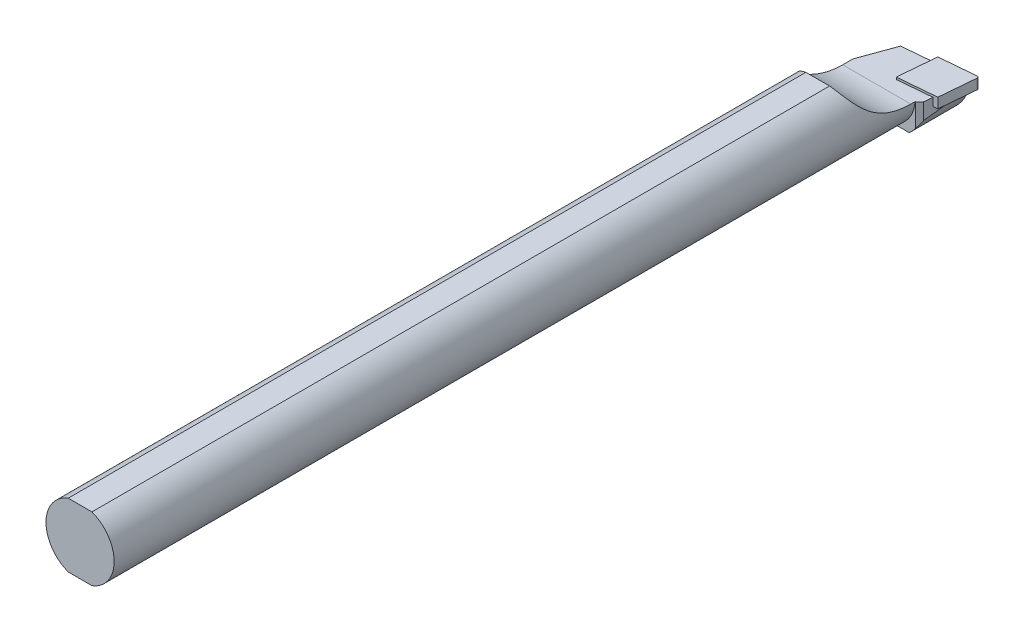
ISO-10303-21;
HEADER;
FILE_DESCRIPTION(('STEP AP214'),'2;1');
FILE_NAME('part.step','',(''),(''),'','','');
FILE_SCHEMA(('AUTOMOTIVE_DESIGN { 1 0 10303 214 1 1 1 1 }'));
ENDSEC;
DATA;
#1=APPLICATION_CONTEXT('core data for automotive mechanical design processes');
#2=APPLICATION_PROTOCOL_DEFINITION('international standard','automotive_design',2000,#1);
#3=PRODUCT_CONTEXT('',#1,'mechanical');
#4=PRODUCT('Part','Part','',(#3));
#5=PRODUCT_RELATED_PRODUCT_CATEGORY('part','',(#4));
#6=PRODUCT_DEFINITION_FORMATION('','',#4);
#7=PRODUCT_DEFINITION_CONTEXT('part definition',#1,'design');
#8=PRODUCT_DEFINITION('design','',#6,#7);
#9=PRODUCT_DEFINITION_SHAPE('','',#8);
#10=(LENGTH_UNIT() NAMED_UNIT(*) SI_UNIT(.MILLI.,.METRE.));
#11=(NAMED_UNIT(*) PLANE_ANGLE_UNIT() SI_UNIT($,.RADIAN.));
#12=(NAMED_UNIT(*) SI_UNIT($,.STERADIAN.) SOLID_ANGLE_UNIT());
#13=UNCERTAINTY_MEASURE_WITH_UNIT(LENGTH_MEASURE(1.E-05),#10,'distance_accuracy_value','');
#14=(GEOMETRIC_REPRESENTATION_CONTEXT(3) GLOBAL_UNCERTAINTY_ASSIGNED_CONTEXT((#13)) GLOBAL_UNIT_ASSIGNED_CONTEXT((#10,
#11,#12)) REPRESENTATION_CONTEXT('',''));
#15=CARTESIAN_POINT('',(0.,0.,0.));
#16=DIRECTION('',(0.,0.,1.));
#17=DIRECTION('',(1.,0.,0.));
#18=AXIS2_PLACEMENT_3D('',#15,#16,#17);
#19=CARTESIAN_POINT('',(-11.,0.,200.));
#20=DIRECTION('',(0.,0.,1.));
#21=DIRECTION('',(1.,0.,0.));
#22=AXIS2_PLACEMENT_3D('',#19,#20,#21);
#23=CYLINDRICAL_SURFACE('',#22,8.00000000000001);
#24=CARTESIAN_POINT('',(-11.,0.,1.96619513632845));
#25=DIRECTION('',(0.0871557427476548,0.,0.996194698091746));
#26=DIRECTION('',(-0.996194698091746,0.,0.0871557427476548));
#27=AXIS2_PLACEMENT_3D('',#24,#25,#26);
#28=ELLIPSE('',#27,8.03055870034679,8.00000000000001);
#29=CARTESIAN_POINT('',(-16.,-6.24499799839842,2.40363845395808));
#30=VERTEX_POINT('',#29);
#31=CARTESIAN_POINT('',(-13.783882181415,-7.50000000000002,2.20975326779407));
#32=VERTEX_POINT('',#31);
#33=EDGE_CURVE('E166',#30,#32,#28,.T.);
#34=ORIENTED_EDGE('',*,*,#33,.T.);
#35=DIRECTION('',(0.,0.,1.));
#36=VECTOR('',#35,1.);
#37=CARTESIAN_POINT('',(-13.783882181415,-7.50000000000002,200.));
#38=LINE('',#37,#36);
#39=CARTESIAN_POINT('',(-13.783882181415,-7.50000000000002,200.));
#40=VERTEX_POINT('',#39);
#41=EDGE_CURVE('E155',#32,#40,#38,.T.);
#42=ORIENTED_EDGE('',*,*,#41,.T.);
#43=CARTESIAN_POINT('',(-11.,0.,200.));
#44=DIRECTION('',(0.,0.,1.));
#45=DIRECTION('',(1.,0.,0.));
#46=AXIS2_PLACEMENT_3D('',#43,#44,#45);
#47=CIRCLE('',#46,8.00000000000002);
#48=CARTESIAN_POINT('',(-13.7838821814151,7.49999999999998,200.));
#49=VERTEX_POINT('',#48);
#50=EDGE_CURVE('E164',#49,#40,#47,.T.);
#51=ORIENTED_EDGE('',*,*,#50,.F.);
#52=DIRECTION('',(0.,0.,1.));
#53=VECTOR('',#52,1.);
#54=CARTESIAN_POINT('',(-13.7838821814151,7.49999999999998,200.));
#55=LINE('',#54,#53);
#56=CARTESIAN_POINT('',(-13.783882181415,7.5,26.856406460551));
#57=VERTEX_POINT('',#56);
#58=EDGE_CURVE('E302',#49,#57,#55,.F.);
#59=ORIENTED_EDGE('',*,*,#58,.T.);
#60=CARTESIAN_POINT('',(-3.01564028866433,-0.5,13.));
#61=CARTESIAN_POINT('',(-3.01565806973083,-0.500002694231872,13.2241838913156));
#62=CARTESIAN_POINT('',(-3.01534568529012,-0.495288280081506,13.4483654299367));
#63=CARTESIAN_POINT('',(-3.01418993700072,-0.476446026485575,13.8963298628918));
#64=CARTESIAN_POINT('',(-3.01334657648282,-0.46231824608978,14.1201127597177));
#65=CARTESIAN_POINT('',(-3.01125799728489,-0.424665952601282,14.5669374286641));
#66=CARTESIAN_POINT('',(-3.01001269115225,-0.401139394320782,14.7899790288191));
#67=CARTESIAN_POINT('',(-3.00738212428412,-0.344736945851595,15.2348607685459));
#68=CARTESIAN_POINT('',(-3.00599686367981,-0.311861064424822,15.4567009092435));
#69=CARTESIAN_POINT('',(-3.00210797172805,-0.198886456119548,16.1221890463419));
#70=CARTESIAN_POINT('',(-2.99988819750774,-0.104632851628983,16.56352245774));
#71=CARTESIAN_POINT('',(-3.00011995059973,0.120780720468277,17.4365342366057));
#72=CARTESIAN_POINT('',(-3.00257045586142,0.251932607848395,17.8682146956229));
#73=CARTESIAN_POINT('',(-3.0162908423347,0.525146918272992,18.6475245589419));
#74=CARTESIAN_POINT('',(-3.02601420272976,0.661699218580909,18.9971178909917));
#75=CARTESIAN_POINT('',(-3.05626741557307,0.958869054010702,19.6855076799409));
#76=CARTESIAN_POINT('',(-3.07679750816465,1.11948712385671,20.0243038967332));
#77=CARTESIAN_POINT('',(-3.13300000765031,1.46305150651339,20.6878642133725));
#78=CARTESIAN_POINT('',(-3.16862794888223,1.64593113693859,21.0126664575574));
#79=CARTESIAN_POINT('',(-3.25995757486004,2.03252659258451,21.646665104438));
#80=CARTESIAN_POINT('',(-3.31565156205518,2.23623440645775,21.9558674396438));
#81=CARTESIAN_POINT('',(-3.43255867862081,2.59979184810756,22.4685135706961));
#82=CARTESIAN_POINT('',(-3.4874631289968,2.75518082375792,22.6765761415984));
#83=CARTESIAN_POINT('',(-3.61201250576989,3.073573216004,23.0821782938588));
#84=CARTESIAN_POINT('',(-3.68165365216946,3.23657467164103,23.2797205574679));
#85=CARTESIAN_POINT('',(-3.83750967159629,3.56823018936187,23.6628803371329));
#86=CARTESIAN_POINT('',(-3.92370925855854,3.73687892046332,23.8485086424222));
#87=CARTESIAN_POINT('',(-4.11444192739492,4.07764459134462,24.2067329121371));
#88=CARTESIAN_POINT('',(-4.21897195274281,4.24976094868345,24.3793310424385));
#89=CARTESIAN_POINT('',(-4.42855230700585,4.56571370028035,24.6825080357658));
#90=CARTESIAN_POINT('',(-4.53057824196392,4.70945430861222,24.8152806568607));
#91=CARTESIAN_POINT('',(-4.74880642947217,4.9954900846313,25.0702925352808));
#92=CARTESIAN_POINT('',(-4.86500584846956,5.13778553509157,25.1925338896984));
#93=CARTESIAN_POINT('',(-5.11182922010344,5.41889505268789,25.4259691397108));
#94=CARTESIAN_POINT('',(-5.24245239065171,5.55770930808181,25.5371636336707));
#95=CARTESIAN_POINT('',(-5.51802931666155,5.82970605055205,25.7481388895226));
#96=CARTESIAN_POINT('',(-5.66298329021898,5.96288845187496,25.8479194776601));
#97=CARTESIAN_POINT('',(-5.96747629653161,6.22204619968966,26.0363096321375));
#98=CARTESIAN_POINT('',(-6.12708123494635,6.34798437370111,26.1248639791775));
#99=CARTESIAN_POINT('',(-6.45945948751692,6.58982009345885,26.2902281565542));
#100=CARTESIAN_POINT('',(-6.63223305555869,6.70571744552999,26.367037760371));
#101=CARTESIAN_POINT('',(-6.9897868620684,6.92547654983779,26.509059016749));
#102=CARTESIAN_POINT('',(-7.17456693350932,7.029338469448,26.5742708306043));
#103=CARTESIAN_POINT('',(-7.55470825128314,7.22325991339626,26.693375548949));
#104=CARTESIAN_POINT('',(-7.75006875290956,7.3133204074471,26.747269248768));
#105=CARTESIAN_POINT('',(-8.13274694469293,7.47114410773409,26.8399827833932));
#106=CARTESIAN_POINT('',(-8.31933737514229,7.5401517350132,26.8796943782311));
#107=CARTESIAN_POINT('',(-8.69866809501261,7.66444396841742,26.9502392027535));
#108=CARTESIAN_POINT('',(-8.89140827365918,7.71972882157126,26.9810725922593));
#109=CARTESIAN_POINT('',(-9.28159094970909,7.8158453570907,27.0341292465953));
#110=CARTESIAN_POINT('',(-9.47903284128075,7.85667889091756,27.0563536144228));
#111=CARTESIAN_POINT('',(-9.87718442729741,7.92338488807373,27.0924215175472));
#112=CARTESIAN_POINT('',(-10.0778941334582,7.94925729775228,27.1062650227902));
#113=CARTESIAN_POINT('',(-10.4771237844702,7.98536044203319,27.1255301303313));
#114=CARTESIAN_POINT('',(-10.6756091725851,7.99588876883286,27.1311119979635));
#115=CARTESIAN_POINT('',(-11.0728736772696,8.00213420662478,27.1344268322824));
#116=CARTESIAN_POINT('',(-11.2716527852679,7.99785174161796,27.1321600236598));
#117=CARTESIAN_POINT('',(-11.6680881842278,7.97452713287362,27.1197532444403));
#118=CARTESIAN_POINT('',(-11.8657445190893,7.95548557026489,27.1096135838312));
#119=CARTESIAN_POINT('',(-12.258537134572,7.90286956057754,27.0813528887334));
#120=CARTESIAN_POINT('',(-12.453673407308,7.86929506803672,27.0632318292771));
#121=CARTESIAN_POINT('',(-12.8400229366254,7.78802157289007,27.0188276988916));
#122=CARTESIAN_POINT('',(-13.0312364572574,7.74032352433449,26.9925451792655));
#123=CARTESIAN_POINT('',(-13.4083955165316,7.63139296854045,26.9315797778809));
#124=CARTESIAN_POINT('',(-13.5943410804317,7.57016052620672,26.8968969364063));
#125=CARTESIAN_POINT('',(-13.9596305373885,7.43495191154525,26.8188670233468));
#126=CARTESIAN_POINT('',(-14.1389754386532,7.36097769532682,26.7755212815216));
#127=CARTESIAN_POINT('',(-14.4898646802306,7.20125011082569,26.6798906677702));
#128=CARTESIAN_POINT('',(-14.6614090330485,7.11549676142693,26.627605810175));
#129=CARTESIAN_POINT('',(-14.9957920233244,6.93324951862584,26.5137831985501));
#130=CARTESIAN_POINT('',(-15.1586192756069,6.83674206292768,26.4522337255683));
#131=CARTESIAN_POINT('',(-15.4743541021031,6.63440379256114,26.3197529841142));
#132=CARTESIAN_POINT('',(-15.6272617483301,6.52857304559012,26.2488217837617));
#133=CARTESIAN_POINT('',(-15.9223591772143,6.30905680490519,26.0974931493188));
#134=CARTESIAN_POINT('',(-16.0645494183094,6.19537164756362,26.0170961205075));
#135=CARTESIAN_POINT('',(-16.3376423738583,5.96170061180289,25.8468570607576));
#136=CARTESIAN_POINT('',(-16.4685448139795,5.8417145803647,25.757014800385));
#137=CARTESIAN_POINT('',(-16.7225449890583,5.59329909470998,25.5651362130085));
#138=CARTESIAN_POINT('',(-16.8452812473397,5.46472361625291,25.4628108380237));
#139=CARTESIAN_POINT('',(-17.0782811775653,5.20432784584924,25.2485738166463));
#140=CARTESIAN_POINT('',(-17.1885448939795,5.07250756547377,25.1366622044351));
#141=CARTESIAN_POINT('',(-17.3967687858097,4.80726366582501,24.9036359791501));
#142=CARTESIAN_POINT('',(-17.4947270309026,4.67383979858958,24.7825199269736));
#143=CARTESIAN_POINT('',(-17.678714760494,4.40693282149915,24.531584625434));
#144=CARTESIAN_POINT('',(-17.7647418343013,4.2734497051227,24.4017636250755));
#145=CARTESIAN_POINT('',(-17.9571517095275,3.9553647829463,24.0810875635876));
#146=CARTESIAN_POINT('',(-18.058162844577,3.77138616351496,23.8863704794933));
#147=CARTESIAN_POINT('',(-18.2400537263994,3.40921290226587,23.4826758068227));
#148=CARTESIAN_POINT('',(-18.32092691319,3.23102016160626,23.2736935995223));
#149=CARTESIAN_POINT('',(-18.4649875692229,2.88263120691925,22.8427089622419));
#150=CARTESIAN_POINT('',(-18.5281423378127,2.71245025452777,22.6206833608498));
#151=CARTESIAN_POINT('',(-18.6390266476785,2.382349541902,22.1654977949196));
#152=CARTESIAN_POINT('',(-18.6867556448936,2.22243014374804,21.9323374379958));
#153=CARTESIAN_POINT('',(-18.7846014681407,1.85686698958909,21.3675711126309));
#154=CARTESIAN_POINT('',(-18.8289917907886,1.6563658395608,21.031631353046));
#155=CARTESIAN_POINT('',(-18.8992861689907,1.27983450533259,20.3444263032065));
#156=CARTESIAN_POINT('',(-18.9251830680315,1.10381381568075,19.9931551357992));
#157=CARTESIAN_POINT('',(-18.963811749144,0.777633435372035,19.2774848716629));
#158=CARTESIAN_POINT('',(-18.9765228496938,0.627514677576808,18.9130660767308));
#159=CARTESIAN_POINT('',(-18.9933091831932,0.354557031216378,18.1740427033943));
#160=CARTESIAN_POINT('',(-18.9973856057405,0.231714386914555,17.7994395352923));
#161=CARTESIAN_POINT('',(-19.0006427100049,0.0195267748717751,17.0613857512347));
#162=CARTESIAN_POINT('',(-19.000060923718,-0.0711998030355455,16.6983313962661));
#163=CARTESIAN_POINT('',(-18.9971601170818,-0.226993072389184,15.9667359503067));
#164=CARTESIAN_POINT('',(-18.9948411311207,-0.292060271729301,15.5981949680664));
#165=CARTESIAN_POINT('',(-18.9914760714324,-0.370068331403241,15.0434410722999));
#166=CARTESIAN_POINT('',(-18.990375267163,-0.392780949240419,14.8585515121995));
#167=CARTESIAN_POINT('',(-18.988365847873,-0.431738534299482,14.4880825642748));
#168=CARTESIAN_POINT('',(-18.98745723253,-0.447983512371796,14.3025031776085));
#169=CARTESIAN_POINT('',(-18.9859574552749,-0.47398352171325,13.930884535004));
#170=CARTESIAN_POINT('',(-18.9853663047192,-0.483738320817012,13.7448452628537));
#171=CARTESIAN_POINT('',(-18.984563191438,-0.496747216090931,13.372537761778));
#172=CARTESIAN_POINT('',(-18.9843512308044,-0.500001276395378,13.1862695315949));
#173=CARTESIAN_POINT('',(-18.9843597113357,-0.500000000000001,13.));
#174=B_SPLINE_CURVE_WITH_KNOTS('',3,(#60,#61,#62,#63,#64,#65,#66,#67,#68,#69,#70,#71,#72,#73,
#74,#75,#76,#77,#78,#79,#80,#81,#82,#83,#84,#85,#86,#87,#88,#89,#90,#91,#92,#93,#94,#95,#96,#97,
#98,#99,#100,#101,#102,#103,#104,#105,#106,#107,#108,#109,#110,#111,#112,#113,#114,#115,#116,
#117,#118,#119,#120,#121,#122,#123,#124,#125,#126,#127,#128,#129,#130,#131,#132,#133,#134,#135,
#136,#137,#138,#139,#140,#141,#142,#143,#144,#145,#146,#147,#148,#149,#150,#151,#152,#153,#154,
#155,#156,#157,#158,#159,#160,#161,#162,#163,#164,#165,#166,#167,#168,#169,#170,#171,#172,#173),
.UNSPECIFIED.,.F.,.F.,(4,2,2,2,2,2,2,2,2,2,2,2,2,2,2,2,2,2,2,2,2,2,2,2,2,2,2,2,2,2,2,2,2,2,2,2,
2,2,2,2,2,2,2,2,2,2,2,2,2,2,2,2,2,2,2,2,4),(0.,0.672497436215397,1.34499065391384,
2.01763028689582,2.69026928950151,4.04239668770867,5.39422821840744,6.51955457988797,
7.64490594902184,8.76696575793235,9.88859559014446,10.6842338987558,11.4796683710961,
12.2743720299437,13.068943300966,13.7303228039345,14.3915703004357,15.0527819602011,
15.7140036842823,16.3783610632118,17.0427312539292,17.7070922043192,18.3714064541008,
18.9792693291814,19.5871212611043,20.1948952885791,20.8026714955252,21.3984956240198,
21.9943026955,22.5900863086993,23.1858717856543,23.7816170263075,24.3773594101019,
24.9730104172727,25.5686604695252,26.1650704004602,26.7614760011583,27.3578560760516,
27.9542506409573,28.5688979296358,29.1835430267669,29.7982844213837,30.4131498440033,
31.2707553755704,32.1286399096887,32.9880974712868,33.8475853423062,35.0270580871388,
36.2069870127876,37.3887638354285,38.5703778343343,39.6921376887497,40.8138753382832,
41.3726307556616,41.9313852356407,42.4901597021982,43.0489372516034),.UNSPECIFIED.);
#175=CARTESIAN_POINT('',(-18.9843597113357,-0.5,13.));
#176=VERTEX_POINT('',#175);
#177=EDGE_CURVE('E184',#57,#176,#174,.T.);
#178=ORIENTED_EDGE('',*,*,#177,.T.);
#179=DIRECTION('',(0.,0.,1.));
#180=VECTOR('',#179,1.);
#181=CARTESIAN_POINT('',(-18.9843597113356,-0.500000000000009,200.));
#182=LINE('',#181,#180);
#183=CARTESIAN_POINT('',(-18.9843597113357,-0.499999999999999,10.6030993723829));
#184=VERTEX_POINT('',#183);
#185=EDGE_CURVE('E289',#176,#184,#182,.F.);
#186=ORIENTED_EDGE('',*,*,#185,.T.);
#187=CARTESIAN_POINT('',(-11.,0.,-11.333748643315));
#188=DIRECTION('',(0.939692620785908,0.,0.342020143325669));
#189=DIRECTION('',(-0.342020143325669,0.,0.939692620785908));
#190=AXIS2_PLACEMENT_3D('',#187,#188,#189);
#191=ELLIPSE('',#190,23.3904352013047,8.00000000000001);
#192=EDGE_CURVE('E174',#184,#30,#191,.T.);
#193=ORIENTED_EDGE('',*,*,#192,.T.);
#194=EDGE_LOOP('',(#34,#42,#51,#59,#178,#186,#193));
#195=FACE_BOUND('',#194,.T.);
#196=ADVANCED_FACE('F30',(#195),#23,.T.);
#197=CARTESIAN_POINT('',(-11.,0.,50.));
#198=DIRECTION('',(0.,0.,-1.));
#199=DIRECTION('',(-1.,0.,0.));
#200=AXIS2_PLACEMENT_3D('',#197,#198,#199);
#201=CYLINDRICAL_SURFACE('',#200,10.);
#202=DIRECTION('',(0.,0.,-1.));
#203=VECTOR('',#202,1.);
#204=CARTESIAN_POINT('',(-4.38562172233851,-7.50000000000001,50.));
#205=LINE('',#204,#203);
#206=CARTESIAN_POINT('',(-4.38562172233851,-7.5,1.38751202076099));
#207=VERTEX_POINT('',#206);
#208=CARTESIAN_POINT('',(-4.38562172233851,-7.5,12.));
#209=VERTEX_POINT('',#208);
#210=EDGE_CURVE('E251',#207,#209,#205,.F.);
#211=ORIENTED_EDGE('',*,*,#210,.F.);
#212=CARTESIAN_POINT('',(-11.,0.,1.96619513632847));
#213=DIRECTION('',(0.0871557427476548,0.,0.996194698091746));
#214=DIRECTION('',(0.996194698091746,0.,-0.0871557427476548));
#215=AXIS2_PLACEMENT_3D('',#212,#213,#214);
#216=ELLIPSE('',#215,10.0381983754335,10.);
#217=CARTESIAN_POINT('',(-1.28734845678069,-2.38,1.11644823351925));
#218=VERTEX_POINT('',#217);
#219=EDGE_CURVE('E256',#207,#218,#216,.T.);
#220=ORIENTED_EDGE('',*,*,#219,.T.);
#221=DIRECTION('',(0.,0.,-1.));
#222=VECTOR('',#221,1.);
#223=CARTESIAN_POINT('',(-1.28734845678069,-2.38,50.));
#224=LINE('',#223,#222);
#225=CARTESIAN_POINT('',(-1.28734845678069,-2.38,3.24074694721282));
#226=VERTEX_POINT('',#225);
#227=EDGE_CURVE('E192',#218,#226,#224,.F.);
#228=ORIENTED_EDGE('',*,*,#227,.T.);
#229=CARTESIAN_POINT('',(-11.,0.,114.256862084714));
#230=DIRECTION('',(0.996194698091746,0.,0.0871557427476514));
#231=DIRECTION('',(0.0871557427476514,0.,-0.996194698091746));
#232=AXIS2_PLACEMENT_3D('',#229,#230,#231);
#233=ELLIPSE('',#232,114.737132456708,10.);
#234=CARTESIAN_POINT('',(-1.97162029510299,-4.29980928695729,11.062009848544));
#235=VERTEX_POINT('',#234);
#236=EDGE_CURVE('E266',#235,#226,#233,.T.);
#237=ORIENTED_EDGE('',*,*,#236,.F.);
#238=CARTESIAN_POINT('',(-11.,0.,20.090389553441));
#239=DIRECTION('',(0.707106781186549,0.,0.707106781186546));
#240=DIRECTION('',(0.707106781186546,0.,-0.707106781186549));
#241=AXIS2_PLACEMENT_3D('',#238,#239,#240);
#242=ELLIPSE('',#241,14.142135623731,10.);
#243=CARTESIAN_POINT('',(-2.90961044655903,-5.87755024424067,12.));
#244=VERTEX_POINT('',#243);
#245=EDGE_CURVE('E254',#244,#235,#242,.T.);
#246=ORIENTED_EDGE('',*,*,#245,.F.);
#247=CARTESIAN_POINT('',(-11.,0.,12.));
#248=DIRECTION('',(0.,0.,1.));
#249=DIRECTION('',(0.,-1.,0.));
#250=AXIS2_PLACEMENT_3D('',#247,#248,#249);
#251=CIRCLE('',#250,10.);
#252=EDGE_CURVE('E245',#209,#244,#251,.T.);
#253=ORIENTED_EDGE('',*,*,#252,.F.);
#254=EDGE_LOOP('',(#211,#220,#228,#237,#246,#253));
#255=FACE_BOUND('',#254,.T.);
#256=ADVANCED_FACE('F212',(#255),#201,.T.);
#257=CARTESIAN_POINT('',(-16.,-50.,2.40363845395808));
#258=DIRECTION('',(0.0871557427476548,0.,0.996194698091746));
#259=DIRECTION('',(0.996194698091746,0.,-0.0871557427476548));
#260=AXIS2_PLACEMENT_3D('',#257,#258,#259);
#261=PLANE('',#260);
#262=ORIENTED_EDGE('',*,*,#219,.F.);
#263=DIRECTION('',(-0.996194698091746,0.,0.0871557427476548));
#264=VECTOR('',#263,1.);
#265=CARTESIAN_POINT('',(-16.,-7.5,2.40363845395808));
#266=LINE('',#265,#264);
#267=EDGE_CURVE('E249',#207,#32,#266,.T.);
#268=ORIENTED_EDGE('',*,*,#267,.T.);
#269=ORIENTED_EDGE('',*,*,#33,.F.);
#270=DIRECTION('',(0.,1.,0.));
#271=VECTOR('',#270,1.);
#272=CARTESIAN_POINT('',(-16.,-50.,2.40363845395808));
#273=LINE('',#272,#271);
#274=CARTESIAN_POINT('',(-16.,-0.5,2.40363845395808));
#275=VERTEX_POINT('',#274);
#276=EDGE_CURVE('E176',#30,#275,#273,.T.);
#277=ORIENTED_EDGE('',*,*,#276,.T.);
#278=DIRECTION('',(0.996194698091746,0.,-0.0871557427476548));
#279=VECTOR('',#278,1.);
#280=CARTESIAN_POINT('',(-16.,-0.5,2.40363845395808));
#281=LINE('',#280,#279);
#282=CARTESIAN_POINT('',(-9.01744742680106,-0.5,1.79274426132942));
#283=VERTEX_POINT('',#282);
#284=EDGE_CURVE('E181',#275,#283,#281,.T.);
#285=ORIENTED_EDGE('',*,*,#284,.T.);
#286=DIRECTION('',(0.,-1.,0.));
#287=VECTOR('',#286,1.);
#288=CARTESIAN_POINT('',(-9.01744742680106,-50.,1.79274426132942));
#289=LINE('',#288,#287);
#290=CARTESIAN_POINT('',(-9.01744742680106,-2.38,1.79274426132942));
#291=VERTEX_POINT('',#290);
#292=EDGE_CURVE('E257',#283,#291,#289,.T.);
#293=ORIENTED_EDGE('',*,*,#292,.T.);
#294=DIRECTION('',(-0.996194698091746,0.,0.0871557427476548));
#295=VECTOR('',#294,1.);
#296=CARTESIAN_POINT('',(-16.,-2.38,2.40363845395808));
#297=LINE('',#296,#295);
#298=EDGE_CURVE('E312',#218,#291,#297,.T.);
#299=ORIENTED_EDGE('',*,*,#298,.F.);
#300=EDGE_LOOP('',(#262,#268,#269,#277,#285,#293,#299));
#301=FACE_BOUND('',#300,.T.);
#302=ADVANCED_FACE('F208',(#301),#261,.F.);
#303=CARTESIAN_POINT('',(-11.,-8.,12.));
#304=DIRECTION('',(0.,0.,1.));
#305=DIRECTION('',(0.,-1.,0.));
#306=AXIS2_PLACEMENT_3D('',#303,#304,#305);
#307=PLANE('',#306);
#308=DIRECTION('',(-1.,0.,0.));
#309=VECTOR('',#308,1.);
#310=CARTESIAN_POINT('',(-11.,-7.5,12.));
#311=LINE('',#310,#309);
#312=CARTESIAN_POINT('',(-8.21611781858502,-7.50000000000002,12.));
#313=VERTEX_POINT('',#312);
#314=EDGE_CURVE('E167',#209,#313,#311,.T.);
#315=ORIENTED_EDGE('',*,*,#314,.F.);
#316=ORIENTED_EDGE('',*,*,#252,.T.);
#317=DIRECTION('',(0.,1.,0.));
#318=VECTOR('',#317,1.);
#319=CARTESIAN_POINT('',(-2.90961044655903,-8.,12.));
#320=LINE('',#319,#318);
#321=CARTESIAN_POINT('',(-2.90961044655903,-0.499999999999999,12.));
#322=VERTEX_POINT('',#321);
#323=EDGE_CURVE('E278',#244,#322,#320,.T.);
#324=ORIENTED_EDGE('',*,*,#323,.T.);
#325=DIRECTION('',(1.,0.,0.));
#326=VECTOR('',#325,1.);
#327=CARTESIAN_POINT('',(-11.,-0.499999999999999,12.));
#328=LINE('',#327,#326);
#329=CARTESIAN_POINT('',(-3.01564028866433,-0.499999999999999,12.));
#330=VERTEX_POINT('',#329);
#331=EDGE_CURVE('E272',#330,#322,#328,.T.);
#332=ORIENTED_EDGE('',*,*,#331,.F.);
#333=CARTESIAN_POINT('',(-11.,0.,12.));
#334=DIRECTION('',(0.,0.,1.));
#335=DIRECTION('',(0.,-1.,0.));
#336=AXIS2_PLACEMENT_3D('',#333,#334,#335);
#337=CIRCLE('',#336,8.00000000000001);
#338=EDGE_CURVE('E248',#313,#330,#337,.T.);
#339=ORIENTED_EDGE('',*,*,#338,.F.);
#340=EDGE_LOOP('',(#315,#316,#324,#332,#339));
#341=FACE_BOUND('',#340,.T.);
#342=ADVANCED_FACE('F211',(#341),#307,.T.);
#343=CARTESIAN_POINT('',(-1.97162029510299,-8.,11.062009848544));
#344=DIRECTION('',(0.996194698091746,0.,0.0871557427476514));
#345=DIRECTION('',(0.0871557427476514,0.,-0.996194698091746));
#346=AXIS2_PLACEMENT_3D('',#343,#344,#345);
#347=PLANE('',#346);
#348=DIRECTION('',(0.,-1.,0.));
#349=VECTOR('',#348,1.);
#350=CARTESIAN_POINT('',(-1.79274426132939,-8.,9.01744742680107));
#351=LINE('',#350,#349);
#352=CARTESIAN_POINT('',(-1.79274426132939,-0.5,9.01744742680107));
#353=VERTEX_POINT('',#352);
#354=CARTESIAN_POINT('',(-1.79274426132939,-2.38,9.01744742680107));
#355=VERTEX_POINT('',#354);
#356=EDGE_CURVE('E261',#353,#355,#351,.T.);
#357=ORIENTED_EDGE('',*,*,#356,.F.);
#358=DIRECTION('',(0.0871557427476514,0.,-0.996194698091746));
#359=VECTOR('',#358,1.);
#360=CARTESIAN_POINT('',(-1.97162029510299,-0.499999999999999,11.062009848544));
#361=LINE('',#360,#359);
#362=CARTESIAN_POINT('',(-1.97162029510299,-0.499999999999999,11.062009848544));
#363=VERTEX_POINT('',#362);
#364=EDGE_CURVE('E269',#363,#353,#361,.T.);
#365=ORIENTED_EDGE('',*,*,#364,.F.);
#366=DIRECTION('',(0.,1.,0.));
#367=VECTOR('',#366,1.);
#368=CARTESIAN_POINT('',(-1.97162029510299,-8.,11.062009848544));
#369=LINE('',#368,#367);
#370=EDGE_CURVE('E279',#235,#363,#369,.T.);
#371=ORIENTED_EDGE('',*,*,#370,.F.);
#372=ORIENTED_EDGE('',*,*,#236,.T.);
#373=DIRECTION('',(-0.0871557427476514,0.,0.996194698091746));
#374=VECTOR('',#373,1.);
#375=CARTESIAN_POINT('',(-1.97162029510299,-2.38,11.062009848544));
#376=LINE('',#375,#374);
#377=EDGE_CURVE('E309',#226,#355,#376,.T.);
#378=ORIENTED_EDGE('',*,*,#377,.T.);
#379=EDGE_LOOP('',(#357,#365,#371,#372,#378));
#380=FACE_BOUND('',#379,.T.);
#381=ADVANCED_FACE('F202',(#380),#347,.T.);
#382=CARTESIAN_POINT('',(-2.90961044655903,-8.,12.));
#383=DIRECTION('',(0.707106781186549,0.,0.707106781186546));
#384=DIRECTION('',(0.707106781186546,0.,-0.707106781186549));
#385=AXIS2_PLACEMENT_3D('',#382,#383,#384);
#386=PLANE('',#385);
#387=ORIENTED_EDGE('',*,*,#323,.F.);
#388=ORIENTED_EDGE('',*,*,#245,.T.);
#389=ORIENTED_EDGE('',*,*,#370,.T.);
#390=DIRECTION('',(0.707106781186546,0.,-0.707106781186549));
#391=VECTOR('',#390,1.);
#392=CARTESIAN_POINT('',(-2.90961044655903,-0.499999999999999,12.));
#393=LINE('',#392,#391);
#394=EDGE_CURVE('E275',#322,#363,#393,.T.);
#395=ORIENTED_EDGE('',*,*,#394,.F.);
#396=EDGE_LOOP('',(#387,#388,#389,#395));
#397=FACE_BOUND('',#396,.T.);
#398=ADVANCED_FACE('F220',(#397),#386,.T.);
#399=CARTESIAN_POINT('',(-8.21611781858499,-7.50000000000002,200.));
#400=VERTEX_POINT('',#399);
#401=CARTESIAN_POINT('',(-8.21611781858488,7.49999999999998,200.));
#402=VERTEX_POINT('',#401);
#403=EDGE_CURVE('E172',#400,#402,#47,.T.);
#404=ORIENTED_EDGE('',*,*,#403,.F.);
#405=DIRECTION('',(0.,0.,1.));
#406=VECTOR('',#405,1.);
#407=CARTESIAN_POINT('',(-8.21611781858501,-7.50000000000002,200.));
#408=LINE('',#407,#406);
#409=EDGE_CURVE('E46',#400,#313,#408,.F.);
#410=ORIENTED_EDGE('',*,*,#409,.T.);
#411=ORIENTED_EDGE('',*,*,#338,.T.);
#412=DIRECTION('',(0.,0.,1.));
#413=VECTOR('',#412,1.);
#414=CARTESIAN_POINT('',(-3.01564028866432,-0.500000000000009,200.));
#415=LINE('',#414,#413);
#416=CARTESIAN_POINT('',(-3.01564028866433,-0.5,13.));
#417=VERTEX_POINT('',#416);
#418=EDGE_CURVE('E291',#330,#417,#415,.T.);
#419=ORIENTED_EDGE('',*,*,#418,.T.);
#420=CARTESIAN_POINT('',(-8.21611781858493,7.49999999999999,26.856406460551));
#421=VERTEX_POINT('',#420);
#422=EDGE_CURVE('E185',#417,#421,#174,.T.);
#423=ORIENTED_EDGE('',*,*,#422,.T.);
#424=DIRECTION('',(0.,0.,1.));
#425=VECTOR('',#424,1.);
#426=CARTESIAN_POINT('',(-8.21611781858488,7.49999999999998,200.));
#427=LINE('',#426,#425);
#428=EDGE_CURVE('E53',#421,#402,#427,.T.);
#429=ORIENTED_EDGE('',*,*,#428,.T.);
#430=EDGE_LOOP('',(#404,#410,#411,#419,#423,#429));
#431=FACE_BOUND('',#430,.T.);
#432=ADVANCED_FACE('F32',(#431),#23,.T.);
#433=CARTESIAN_POINT('',(-11.,0.,200.));
#434=DIRECTION('',(0.,0.,-1.));
#435=DIRECTION('',(-1.,0.,0.));
#436=AXIS2_PLACEMENT_3D('',#433,#434,#435);
#437=PLANE('',#436);
#438=ORIENTED_EDGE('',*,*,#50,.T.);
#439=DIRECTION('',(1.,0.,0.));
#440=VECTOR('',#439,1.);
#441=CARTESIAN_POINT('',(-11.,-7.50000000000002,200.));
#442=LINE('',#441,#440);
#443=EDGE_CURVE('E11',#40,#400,#442,.T.);
#444=ORIENTED_EDGE('',*,*,#443,.T.);
#445=ORIENTED_EDGE('',*,*,#403,.T.);
#446=DIRECTION('',(-1.,0.,0.));
#447=VECTOR('',#446,1.);
#448=CARTESIAN_POINT('',(-11.,7.49999999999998,200.));
#449=LINE('',#448,#447);
#450=EDGE_CURVE('E171',#402,#49,#449,.T.);
#451=ORIENTED_EDGE('',*,*,#450,.T.);
#452=EDGE_LOOP('',(#438,#444,#445,#451));
#453=FACE_BOUND('',#452,.T.);
#454=ADVANCED_FACE('F170',(#453),#437,.F.);
#455=CARTESIAN_POINT('',(-27.6337134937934,-50.,34.36700358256));
#456=DIRECTION('',(0.939692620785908,0.,0.342020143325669));
#457=DIRECTION('',(0.342020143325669,0.,-0.939692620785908));
#458=AXIS2_PLACEMENT_3D('',#455,#456,#457);
#459=PLANE('',#458);
#460=ORIENTED_EDGE('',*,*,#192,.F.);
#461=DIRECTION('',(0.342020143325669,0.,-0.939692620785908));
#462=VECTOR('',#461,1.);
#463=CARTESIAN_POINT('',(-27.6337134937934,-0.5,34.36700358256));
#464=LINE('',#463,#462);
#465=EDGE_CURVE('E286',#184,#275,#464,.T.);
#466=ORIENTED_EDGE('',*,*,#465,.T.);
#467=ORIENTED_EDGE('',*,*,#276,.F.);
#468=EDGE_LOOP('',(#460,#466,#467));
#469=FACE_BOUND('',#468,.T.);
#470=ADVANCED_FACE('F200',(#469),#459,.F.);
#471=CARTESIAN_POINT('',(-50.,15.5,13.));
#472=DIRECTION('',(1.,0.,0.));
#473=DIRECTION('',(0.,0.,-1.));
#474=AXIS2_PLACEMENT_3D('',#471,#472,#473);
#475=CYLINDRICAL_SURFACE('',#474,16.);
#476=ORIENTED_EDGE('',*,*,#177,.F.);
#477=DIRECTION('',(1.,0.,0.));
#478=VECTOR('',#477,1.);
#479=CARTESIAN_POINT('',(-50.,7.5,26.856406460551));
#480=LINE('',#479,#478);
#481=EDGE_CURVE('E39',#57,#421,#480,.T.);
#482=ORIENTED_EDGE('',*,*,#481,.T.);
#483=ORIENTED_EDGE('',*,*,#422,.F.);
#484=DIRECTION('',(1.,0.,0.));
#485=VECTOR('',#484,1.);
#486=CARTESIAN_POINT('',(-50.,-0.5,13.));
#487=LINE('',#486,#485);
#488=EDGE_CURVE('E283',#176,#417,#487,.T.);
#489=ORIENTED_EDGE('',*,*,#488,.F.);
#490=EDGE_LOOP('',(#476,#482,#483,#489));
#491=FACE_BOUND('',#490,.T.);
#492=ADVANCED_FACE('F194',(#491),#475,.F.);
#493=CARTESIAN_POINT('',(-50.,-0.5,-1.));
#494=DIRECTION('',(0.,-1.,0.));
#495=DIRECTION('',(0.,0.,-1.));
#496=AXIS2_PLACEMENT_3D('',#493,#494,#495);
#497=PLANE('',#496);
#498=DIRECTION('',(-0.996194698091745,0.,0.0871557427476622));
#499=VECTOR('',#498,1.);
#500=CARTESIAN_POINT('',(-48.764055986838,-0.5,13.1269047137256));
#501=LINE('',#500,#499);
#502=CARTESIAN_POINT('',(-9.71012882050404,-0.5,9.71012882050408));
#503=VERTEX_POINT('',#502);
#504=EDGE_CURVE('E306',#353,#503,#501,.T.);
#505=ORIENTED_EDGE('',*,*,#504,.T.);
#506=DIRECTION('',(0.0871557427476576,0.,-0.996194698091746));
#507=VECTOR('',#506,1.);
#508=CARTESIAN_POINT('',(-9.08627848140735,-0.5,2.57948681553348));
#509=LINE('',#508,#507);
#510=EDGE_CURVE('E361',#503,#283,#509,.T.);
#511=ORIENTED_EDGE('',*,*,#510,.T.);
#512=ORIENTED_EDGE('',*,*,#284,.F.);
#513=ORIENTED_EDGE('',*,*,#465,.F.);
#514=ORIENTED_EDGE('',*,*,#185,.F.);
#515=ORIENTED_EDGE('',*,*,#488,.T.);
#516=ORIENTED_EDGE('',*,*,#418,.F.);
#517=ORIENTED_EDGE('',*,*,#331,.T.);
#518=ORIENTED_EDGE('',*,*,#394,.T.);
#519=ORIENTED_EDGE('',*,*,#364,.T.);
#520=EDGE_LOOP('',(#505,#511,#512,#513,#514,#515,#516,#517,#518,#519));
#521=FACE_BOUND('',#520,.T.);
#522=ADVANCED_FACE('F199',(#521),#497,.F.);
#523=CARTESIAN_POINT('',(-9.71012882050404,-2.38,9.71012882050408));
#524=DIRECTION('',(-0.996194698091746,0.,-0.0871557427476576));
#525=DIRECTION('',(-0.0871557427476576,0.,0.996194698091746));
#526=AXIS2_PLACEMENT_3D('',#523,#524,#525);
#527=PLANE('',#526);
#528=ORIENTED_EDGE('',*,*,#292,.F.);
#529=ORIENTED_EDGE('',*,*,#510,.F.);
#530=DIRECTION('',(0.,1.,0.));
#531=VECTOR('',#530,1.);
#532=CARTESIAN_POINT('',(-9.71012882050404,-2.38,9.71012882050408));
#533=LINE('',#532,#531);
#534=CARTESIAN_POINT('',(-9.71012882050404,0.,9.71012882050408));
#535=VERTEX_POINT('',#534);
#536=EDGE_CURVE('E317',#503,#535,#533,.T.);
#537=ORIENTED_EDGE('',*,*,#536,.T.);
#538=DIRECTION('',(-0.0871557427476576,0.,0.996194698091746));
#539=VECTOR('',#538,1.);
#540=CARTESIAN_POINT('',(-9.71012882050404,0.,9.71012882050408));
#541=LINE('',#540,#539);
#542=CARTESIAN_POINT('',(-8.92572713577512,0.,0.744376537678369));
#543=VERTEX_POINT('',#542);
#544=EDGE_CURVE('E340',#543,#535,#541,.T.);
#545=ORIENTED_EDGE('',*,*,#544,.F.);
#546=DIRECTION('',(0.,1.,0.));
#547=VECTOR('',#546,1.);
#548=CARTESIAN_POINT('',(-8.92572713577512,-2.38,0.744376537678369));
#549=LINE('',#548,#547);
#550=CARTESIAN_POINT('',(-8.92572713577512,-2.38,0.744376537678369));
#551=VERTEX_POINT('',#550);
#552=EDGE_CURVE('E316',#551,#543,#549,.T.);
#553=ORIENTED_EDGE('',*,*,#552,.F.);
#554=DIRECTION('',(-0.0871557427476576,0.,0.996194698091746));
#555=VECTOR('',#554,1.);
#556=CARTESIAN_POINT('',(-9.71012882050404,-2.38,9.71012882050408));
#557=LINE('',#556,#555);
#558=EDGE_CURVE('E330',#551,#291,#557,.T.);
#559=ORIENTED_EDGE('',*,*,#558,.T.);
#560=EDGE_LOOP('',(#528,#529,#537,#545,#553,#559));
#561=FACE_BOUND('',#560,.T.);
#562=ADVANCED_FACE('F206',(#561),#527,.T.);
#563=CARTESIAN_POINT('',(-0.4,-2.38,0.4));
#564=DIRECTION('',(0.,1.,0.));
#565=DIRECTION('',(0.,0.,1.));
#566=AXIS2_PLACEMENT_3D('',#563,#564,#565);
#567=PLANE('',#566);
#568=ORIENTED_EDGE('',*,*,#227,.F.);
#569=ORIENTED_EDGE('',*,*,#298,.T.);
#570=ORIENTED_EDGE('',*,*,#558,.F.);
#571=DIRECTION('',(-0.996194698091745,0.,0.0871557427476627));
#572=VECTOR('',#571,1.);
#573=CARTESIAN_POINT('',(-8.92572713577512,-2.38,0.744376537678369));
#574=LINE('',#573,#572);
#575=CARTESIAN_POINT('',(-0.434862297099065,-2.38,0.00152212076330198));
#576=VERTEX_POINT('',#575);
#577=EDGE_CURVE('E320',#576,#551,#574,.T.);
#578=ORIENTED_EDGE('',*,*,#577,.F.);
#579=CARTESIAN_POINT('',(-0.4,-2.38,0.4));
#580=DIRECTION('',(0.,1.,0.));
#581=DIRECTION('',(0.,0.,1.));
#582=AXIS2_PLACEMENT_3D('',#579,#580,#581);
#583=CIRCLE('',#582,0.4);
#584=CARTESIAN_POINT('',(-0.0015221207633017,-2.38,0.434862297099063));
#585=VERTEX_POINT('',#584);
#586=EDGE_CURVE('E345',#585,#576,#583,.T.);
#587=ORIENTED_EDGE('',*,*,#586,.F.);
#588=DIRECTION('',(0.0871557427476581,0.,-0.996194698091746));
#589=VECTOR('',#588,1.);
#590=CARTESIAN_POINT('',(-0.0015221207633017,-2.38,0.434862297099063));
#591=LINE('',#590,#589);
#592=CARTESIAN_POINT('',(-0.744376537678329,-2.38,8.92572713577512));
#593=VERTEX_POINT('',#592);
#594=EDGE_CURVE('E348',#593,#585,#591,.T.);
#595=ORIENTED_EDGE('',*,*,#594,.F.);
#596=DIRECTION('',(0.996194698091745,0.,-0.0871557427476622));
#597=VECTOR('',#596,1.);
#598=CARTESIAN_POINT('',(-0.744376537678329,-2.38,8.92572713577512));
#599=LINE('',#598,#597);
#600=EDGE_CURVE('E351',#355,#593,#599,.T.);
#601=ORIENTED_EDGE('',*,*,#600,.F.);
#602=ORIENTED_EDGE('',*,*,#377,.F.);
#603=EDGE_LOOP('',(#568,#569,#570,#578,#587,#595,#601,#602));
#604=FACE_BOUND('',#603,.T.);
#605=ADVANCED_FACE('F367',(#604),#567,.F.);
#606=CARTESIAN_POINT('',(-8.92572713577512,-2.38,0.744376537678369));
#607=DIRECTION('',(-0.0871557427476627,0.,-0.996194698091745));
#608=DIRECTION('',(-0.996194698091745,0.,0.0871557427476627));
#609=AXIS2_PLACEMENT_3D('',#606,#607,#608);
#610=PLANE('',#609);
#611=DIRECTION('',(-0.996194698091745,0.,0.0871557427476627));
#612=VECTOR('',#611,1.);
#613=CARTESIAN_POINT('',(-8.92572713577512,0.,0.744376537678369));
#614=LINE('',#613,#612);
#615=CARTESIAN_POINT('',(-0.434862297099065,0.,0.00152212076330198));
#616=VERTEX_POINT('',#615);
#617=EDGE_CURVE('E327',#616,#543,#614,.T.);
#618=ORIENTED_EDGE('',*,*,#617,.F.);
#619=DIRECTION('',(0.,1.,0.));
#620=VECTOR('',#619,1.);
#621=CARTESIAN_POINT('',(-0.434862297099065,-2.38,0.00152212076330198));
#622=LINE('',#621,#620);
#623=EDGE_CURVE('E324',#576,#616,#622,.T.);
#624=ORIENTED_EDGE('',*,*,#623,.F.);
#625=ORIENTED_EDGE('',*,*,#577,.T.);
#626=ORIENTED_EDGE('',*,*,#552,.T.);
#627=EDGE_LOOP('',(#618,#624,#625,#626));
#628=FACE_BOUND('',#627,.T.);
#629=ADVANCED_FACE('F376',(#628),#610,.T.);
#630=CARTESIAN_POINT('',(-0.4,-2.38,0.4));
#631=DIRECTION('',(0.,1.,0.));
#632=DIRECTION('',(0.,0.,1.));
#633=AXIS2_PLACEMENT_3D('',#630,#631,#632);
#634=CYLINDRICAL_SURFACE('',#633,0.4);
#635=CARTESIAN_POINT('',(-0.4,0.,0.4));
#636=DIRECTION('',(0.,1.,0.));
#637=DIRECTION('',(0.,0.,1.));
#638=AXIS2_PLACEMENT_3D('',#635,#636,#637);
#639=CIRCLE('',#638,0.4);
#640=CARTESIAN_POINT('',(-0.0015221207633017,0.,0.434862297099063));
#641=VERTEX_POINT('',#640);
#642=EDGE_CURVE('E331',#641,#616,#639,.T.);
#643=ORIENTED_EDGE('',*,*,#642,.F.);
#644=DIRECTION('',(0.,1.,0.));
#645=VECTOR('',#644,1.);
#646=CARTESIAN_POINT('',(-0.0015221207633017,-2.38,0.434862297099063));
#647=LINE('',#646,#645);
#648=EDGE_CURVE('E322',#585,#641,#647,.T.);
#649=ORIENTED_EDGE('',*,*,#648,.F.);
#650=ORIENTED_EDGE('',*,*,#586,.T.);
#651=ORIENTED_EDGE('',*,*,#623,.T.);
#652=EDGE_LOOP('',(#643,#649,#650,#651));
#653=FACE_BOUND('',#652,.T.);
#654=ADVANCED_FACE('F379',(#653),#634,.T.);
#655=CARTESIAN_POINT('',(-0.0015221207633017,-2.38,0.434862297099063));
#656=DIRECTION('',(0.996194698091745,0.,0.0871557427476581));
#657=DIRECTION('',(0.0871557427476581,0.,-0.996194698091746));
#658=AXIS2_PLACEMENT_3D('',#655,#656,#657);
#659=PLANE('',#658);
#660=DIRECTION('',(0.0871557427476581,0.,-0.996194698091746));
#661=VECTOR('',#660,1.);
#662=CARTESIAN_POINT('',(-0.0015221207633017,0.,0.434862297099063));
#663=LINE('',#662,#661);
#664=CARTESIAN_POINT('',(-0.744376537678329,0.,8.92572713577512));
#665=VERTEX_POINT('',#664);
#666=EDGE_CURVE('E334',#665,#641,#663,.T.);
#667=ORIENTED_EDGE('',*,*,#666,.F.);
#668=DIRECTION('',(0.,1.,0.));
#669=VECTOR('',#668,1.);
#670=CARTESIAN_POINT('',(-0.744376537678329,-2.38,8.92572713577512));
#671=LINE('',#670,#669);
#672=EDGE_CURVE('E319',#593,#665,#671,.T.);
#673=ORIENTED_EDGE('',*,*,#672,.F.);
#674=ORIENTED_EDGE('',*,*,#594,.T.);
#675=ORIENTED_EDGE('',*,*,#648,.T.);
#676=EDGE_LOOP('',(#667,#673,#674,#675));
#677=FACE_BOUND('',#676,.T.);
#678=ADVANCED_FACE('F384',(#677),#659,.T.);
#679=CARTESIAN_POINT('',(-0.744376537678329,-2.38,8.92572713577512));
#680=DIRECTION('',(0.0871557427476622,0.,0.996194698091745));
#681=DIRECTION('',(0.996194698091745,0.,-0.0871557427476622));
#682=AXIS2_PLACEMENT_3D('',#679,#680,#681);
#683=PLANE('',#682);
#684=ORIENTED_EDGE('',*,*,#504,.F.);
#685=ORIENTED_EDGE('',*,*,#356,.T.);
#686=ORIENTED_EDGE('',*,*,#600,.T.);
#687=ORIENTED_EDGE('',*,*,#672,.T.);
#688=DIRECTION('',(0.996194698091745,0.,-0.0871557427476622));
#689=VECTOR('',#688,1.);
#690=CARTESIAN_POINT('',(-0.744376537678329,0.,8.92572713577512));
#691=LINE('',#690,#689);
#692=EDGE_CURVE('E337',#535,#665,#691,.T.);
#693=ORIENTED_EDGE('',*,*,#692,.F.);
#694=ORIENTED_EDGE('',*,*,#536,.F.);
#695=EDGE_LOOP('',(#684,#685,#686,#687,#693,#694));
#696=FACE_BOUND('',#695,.T.);
#697=ADVANCED_FACE('F386',(#696),#683,.T.);
#698=CARTESIAN_POINT('',(-0.4,0.,0.4));
#699=DIRECTION('',(0.,1.,0.));
#700=DIRECTION('',(0.,0.,1.));
#701=AXIS2_PLACEMENT_3D('',#698,#699,#700);
#702=PLANE('',#701);
#703=ORIENTED_EDGE('',*,*,#544,.T.);
#704=ORIENTED_EDGE('',*,*,#692,.T.);
#705=ORIENTED_EDGE('',*,*,#666,.T.);
#706=ORIENTED_EDGE('',*,*,#642,.T.);
#707=ORIENTED_EDGE('',*,*,#617,.T.);
#708=EDGE_LOOP('',(#703,#704,#705,#706,#707));
#709=FACE_BOUND('',#708,.T.);
#710=ADVANCED_FACE('F388',(#709),#702,.T.);
#711=CARTESIAN_POINT('',(-40.,7.5,-6.));
#712=DIRECTION('',(0.,-1.,0.));
#713=DIRECTION('',(0.,0.,-1.));
#714=AXIS2_PLACEMENT_3D('',#711,#712,#713);
#715=PLANE('',#714);
#716=ORIENTED_EDGE('',*,*,#428,.F.);
#717=ORIENTED_EDGE('',*,*,#481,.F.);
#718=ORIENTED_EDGE('',*,*,#58,.F.);
#719=ORIENTED_EDGE('',*,*,#450,.F.);
#720=EDGE_LOOP('',(#716,#717,#718,#719));
#721=FACE_BOUND('',#720,.T.);
#722=ADVANCED_FACE('F360',(#721),#715,.F.);
#723=CARTESIAN_POINT('',(-40.,-7.5,-6.));
#724=DIRECTION('',(0.,1.,0.));
#725=DIRECTION('',(0.,0.,1.));
#726=AXIS2_PLACEMENT_3D('',#723,#724,#725);
#727=PLANE('',#726);
#728=ORIENTED_EDGE('',*,*,#210,.T.);
#729=ORIENTED_EDGE('',*,*,#314,.T.);
#730=ORIENTED_EDGE('',*,*,#409,.F.);
#731=ORIENTED_EDGE('',*,*,#443,.F.);
#732=ORIENTED_EDGE('',*,*,#41,.F.);
#733=ORIENTED_EDGE('',*,*,#267,.F.);
#734=EDGE_LOOP('',(#728,#729,#730,#731,#732,#733));
#735=FACE_BOUND('',#734,.T.);
#736=ADVANCED_FACE('F154',(#735),#727,.F.);
#737=CLOSED_SHELL('',(#196,#256,#302,#342,#381,#398,#432,#454,#470,#492,#522,#562,#605,#629,
#654,#678,#697,#710,#722,#736));
#738=MANIFOLD_SOLID_BREP('B2',#737);
#739=ADVANCED_BREP_SHAPE_REPRESENTATION('',(#18,#738),#14);
#740=SHAPE_DEFINITION_REPRESENTATION(#9,#739);
ENDSEC;
END-ISO-10303-21;
